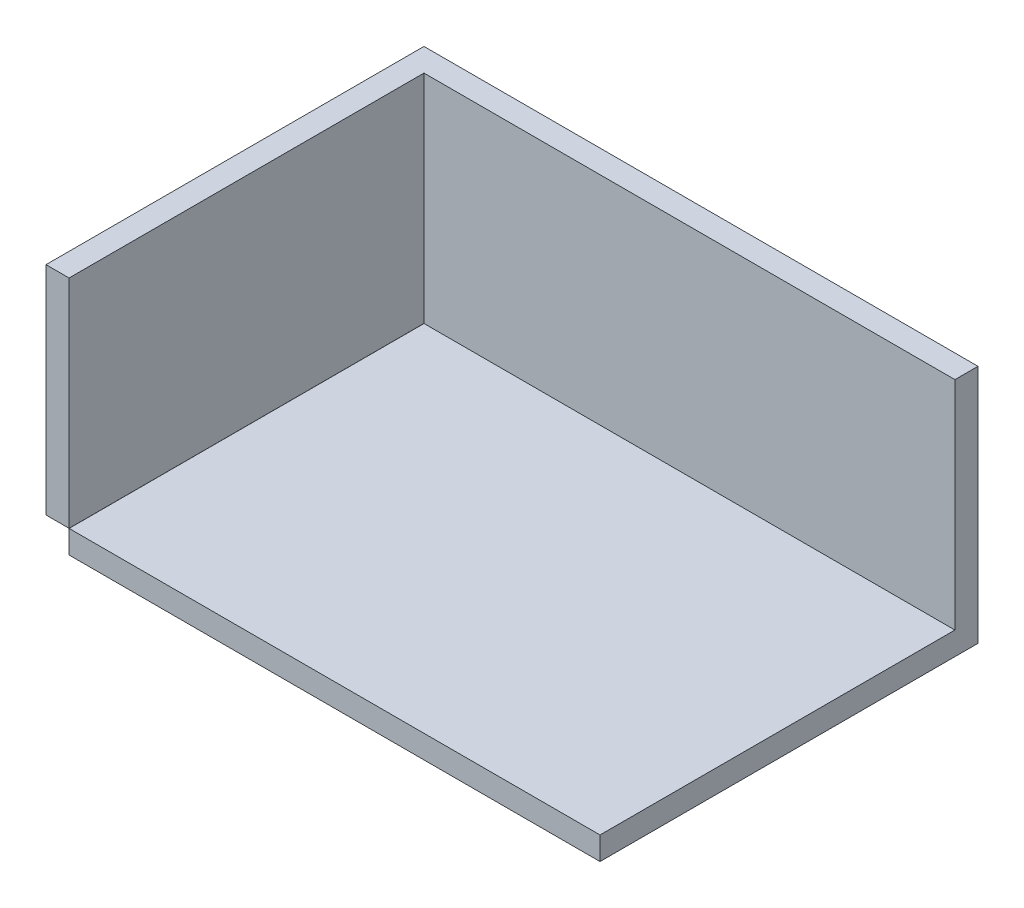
ISO-10303-21;
HEADER;
FILE_DESCRIPTION(('STEP AP214'),'2;1');
FILE_NAME('part.step','',(''),(''),'','','');
FILE_SCHEMA(('AUTOMOTIVE_DESIGN { 1 0 10303 214 1 1 1 1 }'));
ENDSEC;
DATA;
#1=APPLICATION_CONTEXT('core data for automotive mechanical design processes');
#2=APPLICATION_PROTOCOL_DEFINITION('international standard','automotive_design',2000,#1);
#3=PRODUCT_CONTEXT('',#1,'mechanical');
#4=PRODUCT('Part','Part','',(#3));
#5=PRODUCT_RELATED_PRODUCT_CATEGORY('part','',(#4));
#6=PRODUCT_DEFINITION_FORMATION('','',#4);
#7=PRODUCT_DEFINITION_CONTEXT('part definition',#1,'design');
#8=PRODUCT_DEFINITION('design','',#6,#7);
#9=PRODUCT_DEFINITION_SHAPE('','',#8);
#10=(LENGTH_UNIT() NAMED_UNIT(*) SI_UNIT(.MILLI.,.METRE.));
#11=(NAMED_UNIT(*) PLANE_ANGLE_UNIT() SI_UNIT($,.RADIAN.));
#12=(NAMED_UNIT(*) SI_UNIT($,.STERADIAN.) SOLID_ANGLE_UNIT());
#13=UNCERTAINTY_MEASURE_WITH_UNIT(LENGTH_MEASURE(1.E-05),#10,'distance_accuracy_value','');
#14=(GEOMETRIC_REPRESENTATION_CONTEXT(3) GLOBAL_UNCERTAINTY_ASSIGNED_CONTEXT((#13)) GLOBAL_UNIT_ASSIGNED_CONTEXT((#10,
#11,#12)) REPRESENTATION_CONTEXT('',''));
#15=CARTESIAN_POINT('',(0.,0.,0.));
#16=DIRECTION('',(0.,0.,1.));
#17=DIRECTION('',(1.,0.,0.));
#18=AXIS2_PLACEMENT_3D('',#15,#16,#17);
#19=CARTESIAN_POINT('',(-59.6576974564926,5.01,42.078313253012));
#20=DIRECTION('',(0.,-1.,0.));
#21=DIRECTION('',(0.,0.,-1.));
#22=AXIS2_PLACEMENT_3D('',#19,#20,#21);
#23=PLANE('',#22);
#24=DIRECTION('',(0.,0.,-1.));
#25=VECTOR('',#24,1.);
#26=CARTESIAN_POINT('',(-54.6476974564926,5.01,-34.8341365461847));
#27=LINE('',#26,#25);
#28=CARTESIAN_POINT('',(-54.6476974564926,5.01,-34.8341365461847));
#29=VERTEX_POINT('',#28);
#30=CARTESIAN_POINT('',(-54.6476974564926,5.01,-39.8341365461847));
#31=VERTEX_POINT('',#30);
#32=EDGE_CURVE('E11',#29,#31,#27,.T.);
#33=ORIENTED_EDGE('',*,*,#32,.F.);
#34=DIRECTION('',(1.,0.,0.));
#35=VECTOR('',#34,1.);
#36=CARTESIAN_POINT('',(-54.6576974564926,5.01,-34.8341365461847));
#37=LINE('',#36,#35);
#38=CARTESIAN_POINT('',(-54.6576974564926,5.01,-34.8341365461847));
#39=VERTEX_POINT('',#38);
#40=EDGE_CURVE('E153',#39,#29,#37,.T.);
#41=ORIENTED_EDGE('',*,*,#40,.F.);
#42=DIRECTION('',(0.,0.,1.));
#43=VECTOR('',#42,1.);
#44=CARTESIAN_POINT('',(-54.6576974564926,5.01,-34.8341365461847));
#45=LINE('',#44,#43);
#46=CARTESIAN_POINT('',(-54.6576974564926,5.01,42.078313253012));
#47=VERTEX_POINT('',#46);
#48=EDGE_CURVE('E147',#39,#47,#45,.T.);
#49=ORIENTED_EDGE('',*,*,#48,.T.);
#50=DIRECTION('',(-1.,0.,0.));
#51=VECTOR('',#50,1.);
#52=CARTESIAN_POINT('',(-54.6576974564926,5.01,42.078313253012));
#53=LINE('',#52,#51);
#54=CARTESIAN_POINT('',(-59.6576974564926,5.01,42.078313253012));
#55=VERTEX_POINT('',#54);
#56=EDGE_CURVE('E141',#47,#55,#53,.T.);
#57=ORIENTED_EDGE('',*,*,#56,.T.);
#58=DIRECTION('',(0.,0.,1.));
#59=VECTOR('',#58,1.);
#60=CARTESIAN_POINT('',(-59.6576974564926,5.01,-39.8341365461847));
#61=LINE('',#60,#59);
#62=CARTESIAN_POINT('',(-59.6576974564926,5.01,-39.8341365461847));
#63=VERTEX_POINT('',#62);
#64=EDGE_CURVE('E149',#63,#55,#61,.T.);
#65=ORIENTED_EDGE('',*,*,#64,.F.);
#66=DIRECTION('',(1.,0.,0.));
#67=VECTOR('',#66,1.);
#68=CARTESIAN_POINT('',(-59.6576974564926,5.01,-39.8341365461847));
#69=LINE('',#68,#67);
#70=EDGE_CURVE('E39',#63,#31,#69,.T.);
#71=ORIENTED_EDGE('',*,*,#70,.T.);
#72=EDGE_LOOP('',(#33,#41,#49,#57,#65,#71));
#73=FACE_BOUND('',#72,.T.);
#74=ADVANCED_FACE('F32',(#73),#23,.T.);
#75=CARTESIAN_POINT('',(-59.6576974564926,52.,-34.8341365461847));
#76=DIRECTION('',(0.,0.,1.));
#77=DIRECTION('',(1.,0.,0.));
#78=AXIS2_PLACEMENT_3D('',#75,#76,#77);
#79=PLANE('',#78);
#80=DIRECTION('',(0.,-1.,0.));
#81=VECTOR('',#80,1.);
#82=CARTESIAN_POINT('',(-54.6576974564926,52.,-34.8341365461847));
#83=LINE('',#82,#81);
#84=CARTESIAN_POINT('',(-54.6576974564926,52.,-34.8341365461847));
#85=VERTEX_POINT('',#84);
#86=EDGE_CURVE('E203',#85,#39,#83,.T.);
#87=ORIENTED_EDGE('',*,*,#86,.T.);
#88=ORIENTED_EDGE('',*,*,#40,.T.);
#89=DIRECTION('',(0.,1.,0.));
#90=VECTOR('',#89,1.);
#91=CARTESIAN_POINT('',(-54.6476974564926,5.,-34.8341365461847));
#92=LINE('',#91,#90);
#93=CARTESIAN_POINT('',(-54.6476974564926,5.,-34.8341365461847));
#94=VERTEX_POINT('',#93);
#95=EDGE_CURVE('E151',#94,#29,#92,.T.);
#96=ORIENTED_EDGE('',*,*,#95,.F.);
#97=DIRECTION('',(-1.,0.,0.));
#98=VECTOR('',#97,1.);
#99=CARTESIAN_POINT('',(-59.6576974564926,5.,-34.8341365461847));
#100=LINE('',#99,#98);
#101=CARTESIAN_POINT('',(60.4057563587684,5.,-34.8341365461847));
#102=VERTEX_POINT('',#101);
#103=EDGE_CURVE('E124',#102,#94,#100,.T.);
#104=ORIENTED_EDGE('',*,*,#103,.F.);
#105=DIRECTION('',(0.,-1.,0.));
#106=VECTOR('',#105,1.);
#107=CARTESIAN_POINT('',(60.4057563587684,52.,-34.8341365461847));
#108=LINE('',#107,#106);
#109=CARTESIAN_POINT('',(60.4057563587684,52.,-34.8341365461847));
#110=VERTEX_POINT('',#109);
#111=EDGE_CURVE('E123',#110,#102,#108,.T.);
#112=ORIENTED_EDGE('',*,*,#111,.F.);
#113=DIRECTION('',(-1.,0.,0.));
#114=VECTOR('',#113,1.);
#115=CARTESIAN_POINT('',(-59.6576974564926,52.,-34.8341365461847));
#116=LINE('',#115,#114);
#117=EDGE_CURVE('E199',#110,#85,#116,.T.);
#118=ORIENTED_EDGE('',*,*,#117,.T.);
#119=EDGE_LOOP('',(#87,#88,#96,#104,#112,#118));
#120=FACE_BOUND('',#119,.T.);
#121=ADVANCED_FACE('F207',(#120),#79,.T.);
#122=CARTESIAN_POINT('',(-59.6576974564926,52.,-39.8341365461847));
#123=DIRECTION('',(1.,0.,0.));
#124=DIRECTION('',(0.,0.,-1.));
#125=AXIS2_PLACEMENT_3D('',#122,#123,#124);
#126=PLANE('',#125);
#127=DIRECTION('',(0.,-1.,0.));
#128=VECTOR('',#127,1.);
#129=CARTESIAN_POINT('',(-59.6576974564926,52.,-39.8341365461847));
#130=LINE('',#129,#128);
#131=CARTESIAN_POINT('',(-59.6576974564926,52.,-39.8341365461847));
#132=VERTEX_POINT('',#131);
#133=EDGE_CURVE('E136',#132,#63,#130,.T.);
#134=ORIENTED_EDGE('',*,*,#133,.T.);
#135=ORIENTED_EDGE('',*,*,#64,.T.);
#136=DIRECTION('',(0.,-1.,0.));
#137=VECTOR('',#136,1.);
#138=CARTESIAN_POINT('',(-59.6576974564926,52.,42.078313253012));
#139=LINE('',#138,#137);
#140=CARTESIAN_POINT('',(-59.6576974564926,52.,42.078313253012));
#141=VERTEX_POINT('',#140);
#142=EDGE_CURVE('E129',#141,#55,#139,.T.);
#143=ORIENTED_EDGE('',*,*,#142,.F.);
#144=DIRECTION('',(0.,0.,1.));
#145=VECTOR('',#144,1.);
#146=CARTESIAN_POINT('',(-59.6576974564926,52.,-39.8341365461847));
#147=LINE('',#146,#145);
#148=EDGE_CURVE('E180',#132,#141,#147,.T.);
#149=ORIENTED_EDGE('',*,*,#148,.F.);
#150=EDGE_LOOP('',(#134,#135,#143,#149));
#151=FACE_BOUND('',#150,.T.);
#152=ADVANCED_FACE('F191',(#151),#126,.F.);
#153=CARTESIAN_POINT('',(-59.6576974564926,5.,42.078313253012));
#154=DIRECTION('',(0.,1.,0.));
#155=DIRECTION('',(0.,0.,1.));
#156=AXIS2_PLACEMENT_3D('',#153,#154,#155);
#157=PLANE('',#156);
#158=ORIENTED_EDGE('',*,*,#103,.T.);
#159=DIRECTION('',(0.,0.,1.));
#160=VECTOR('',#159,1.);
#161=CARTESIAN_POINT('',(-54.6476974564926,5.,-34.8341365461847));
#162=LINE('',#161,#160);
#163=CARTESIAN_POINT('',(-54.6476974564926,5.,42.078313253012));
#164=VERTEX_POINT('',#163);
#165=EDGE_CURVE('E110',#94,#164,#162,.T.);
#166=ORIENTED_EDGE('',*,*,#165,.T.);
#167=DIRECTION('',(1.,0.,0.));
#168=VECTOR('',#167,1.);
#169=CARTESIAN_POINT('',(-59.6576974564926,5.,42.078313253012));
#170=LINE('',#169,#168);
#171=CARTESIAN_POINT('',(60.4057563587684,5.,42.078313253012));
#172=VERTEX_POINT('',#171);
#173=EDGE_CURVE('E103',#164,#172,#170,.T.);
#174=ORIENTED_EDGE('',*,*,#173,.T.);
#175=DIRECTION('',(0.,0.,-1.));
#176=VECTOR('',#175,1.);
#177=CARTESIAN_POINT('',(60.4057563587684,5.,-39.8341365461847));
#178=LINE('',#177,#176);
#179=EDGE_CURVE('E107',#172,#102,#178,.T.);
#180=ORIENTED_EDGE('',*,*,#179,.T.);
#181=EDGE_LOOP('',(#158,#166,#174,#180));
#182=FACE_BOUND('',#181,.T.);
#183=ADVANCED_FACE('F106',(#182),#157,.T.);
#184=CARTESIAN_POINT('',(-54.6476974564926,5.,42.078313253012));
#185=DIRECTION('',(-1.,0.,0.));
#186=DIRECTION('',(0.,0.,1.));
#187=AXIS2_PLACEMENT_3D('',#184,#185,#186);
#188=PLANE('',#187);
#189=DIRECTION('',(0.,-1.,0.));
#190=VECTOR('',#189,1.);
#191=CARTESIAN_POINT('',(-54.6476974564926,5.,42.078313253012));
#192=LINE('',#191,#190);
#193=CARTESIAN_POINT('',(-54.6476974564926,0.,42.078313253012));
#194=VERTEX_POINT('',#193);
#195=EDGE_CURVE('E133',#164,#194,#192,.T.);
#196=ORIENTED_EDGE('',*,*,#195,.F.);
#197=ORIENTED_EDGE('',*,*,#165,.F.);
#198=ORIENTED_EDGE('',*,*,#95,.T.);
#199=ORIENTED_EDGE('',*,*,#32,.T.);
#200=DIRECTION('',(0.,1.,0.));
#201=VECTOR('',#200,1.);
#202=CARTESIAN_POINT('',(-54.6476974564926,0.,-39.8341365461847));
#203=LINE('',#202,#201);
#204=CARTESIAN_POINT('',(-54.6476974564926,0.,-39.8341365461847));
#205=VERTEX_POINT('',#204);
#206=EDGE_CURVE('E155',#205,#31,#203,.T.);
#207=ORIENTED_EDGE('',*,*,#206,.F.);
#208=DIRECTION('',(0.,0.,1.));
#209=VECTOR('',#208,1.);
#210=CARTESIAN_POINT('',(-54.6476974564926,0.,-39.8341365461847));
#211=LINE('',#210,#209);
#212=EDGE_CURVE('E145',#205,#194,#211,.T.);
#213=ORIENTED_EDGE('',*,*,#212,.T.);
#214=EDGE_LOOP('',(#196,#197,#198,#199,#207,#213));
#215=FACE_BOUND('',#214,.T.);
#216=ADVANCED_FACE('F166',(#215),#188,.T.);
#217=CARTESIAN_POINT('',(-59.6576974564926,52.,42.078313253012));
#218=DIRECTION('',(0.,0.,-1.));
#219=DIRECTION('',(-1.,0.,0.));
#220=AXIS2_PLACEMENT_3D('',#217,#218,#219);
#221=PLANE('',#220);
#222=ORIENTED_EDGE('',*,*,#173,.F.);
#223=ORIENTED_EDGE('',*,*,#195,.T.);
#224=DIRECTION('',(1.,0.,0.));
#225=VECTOR('',#224,1.);
#226=CARTESIAN_POINT('',(-59.6576974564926,0.,42.078313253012));
#227=LINE('',#226,#225);
#228=CARTESIAN_POINT('',(60.4057563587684,0.,42.078313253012));
#229=VERTEX_POINT('',#228);
#230=EDGE_CURVE('E128',#194,#229,#227,.T.);
#231=ORIENTED_EDGE('',*,*,#230,.T.);
#232=DIRECTION('',(0.,-1.,0.));
#233=VECTOR('',#232,1.);
#234=CARTESIAN_POINT('',(60.4057563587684,52.,42.078313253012));
#235=LINE('',#234,#233);
#236=EDGE_CURVE('E120',#172,#229,#235,.T.);
#237=ORIENTED_EDGE('',*,*,#236,.F.);
#238=EDGE_LOOP('',(#222,#223,#231,#237));
#239=FACE_BOUND('',#238,.T.);
#240=ADVANCED_FACE('F126',(#239),#221,.F.);
#241=ORIENTED_EDGE('',*,*,#56,.F.);
#242=DIRECTION('',(0.,-1.,0.));
#243=VECTOR('',#242,1.);
#244=CARTESIAN_POINT('',(-54.6576974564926,52.,42.078313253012));
#245=LINE('',#244,#243);
#246=CARTESIAN_POINT('',(-54.6576974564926,52.,42.078313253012));
#247=VERTEX_POINT('',#246);
#248=EDGE_CURVE('E170',#247,#47,#245,.T.);
#249=ORIENTED_EDGE('',*,*,#248,.F.);
#250=DIRECTION('',(1.,0.,0.));
#251=VECTOR('',#250,1.);
#252=CARTESIAN_POINT('',(-59.6576974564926,52.,42.078313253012));
#253=LINE('',#252,#251);
#254=EDGE_CURVE('E183',#141,#247,#253,.T.);
#255=ORIENTED_EDGE('',*,*,#254,.F.);
#256=ORIENTED_EDGE('',*,*,#142,.T.);
#257=EDGE_LOOP('',(#241,#249,#255,#256));
#258=FACE_BOUND('',#257,.T.);
#259=ADVANCED_FACE('F214',(#258),#221,.F.);
#260=CARTESIAN_POINT('',(60.4057563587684,52.,-39.8341365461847));
#261=DIRECTION('',(-1.,0.,0.));
#262=DIRECTION('',(0.,0.,1.));
#263=AXIS2_PLACEMENT_3D('',#260,#261,#262);
#264=PLANE('',#263);
#265=ORIENTED_EDGE('',*,*,#179,.F.);
#266=ORIENTED_EDGE('',*,*,#236,.T.);
#267=DIRECTION('',(0.,0.,-1.));
#268=VECTOR('',#267,1.);
#269=CARTESIAN_POINT('',(60.4057563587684,0.,-39.8341365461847));
#270=LINE('',#269,#268);
#271=CARTESIAN_POINT('',(60.4057563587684,0.,-39.8341365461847));
#272=VERTEX_POINT('',#271);
#273=EDGE_CURVE('E169',#229,#272,#270,.T.);
#274=ORIENTED_EDGE('',*,*,#273,.T.);
#275=DIRECTION('',(0.,-1.,0.));
#276=VECTOR('',#275,1.);
#277=CARTESIAN_POINT('',(60.4057563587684,52.,-39.8341365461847));
#278=LINE('',#277,#276);
#279=CARTESIAN_POINT('',(60.4057563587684,52.,-39.8341365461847));
#280=VERTEX_POINT('',#279);
#281=EDGE_CURVE('E130',#280,#272,#278,.T.);
#282=ORIENTED_EDGE('',*,*,#281,.F.);
#283=DIRECTION('',(0.,0.,-1.));
#284=VECTOR('',#283,1.);
#285=CARTESIAN_POINT('',(60.4057563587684,52.,-39.8341365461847));
#286=LINE('',#285,#284);
#287=EDGE_CURVE('E186',#110,#280,#286,.T.);
#288=ORIENTED_EDGE('',*,*,#287,.F.);
#289=ORIENTED_EDGE('',*,*,#111,.T.);
#290=EDGE_LOOP('',(#265,#266,#274,#282,#288,#289));
#291=FACE_BOUND('',#290,.T.);
#292=ADVANCED_FACE('F119',(#291),#264,.F.);
#293=CARTESIAN_POINT('',(-59.6576974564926,52.,-39.8341365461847));
#294=DIRECTION('',(0.,0.,1.));
#295=DIRECTION('',(1.,0.,0.));
#296=AXIS2_PLACEMENT_3D('',#293,#294,#295);
#297=PLANE('',#296);
#298=ORIENTED_EDGE('',*,*,#70,.F.);
#299=ORIENTED_EDGE('',*,*,#133,.F.);
#300=DIRECTION('',(-1.,0.,0.));
#301=VECTOR('',#300,1.);
#302=CARTESIAN_POINT('',(-59.6576974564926,52.,-39.8341365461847));
#303=LINE('',#302,#301);
#304=EDGE_CURVE('E188',#280,#132,#303,.T.);
#305=ORIENTED_EDGE('',*,*,#304,.F.);
#306=ORIENTED_EDGE('',*,*,#281,.T.);
#307=DIRECTION('',(-1.,0.,0.));
#308=VECTOR('',#307,1.);
#309=CARTESIAN_POINT('',(-59.6576974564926,0.,-39.8341365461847));
#310=LINE('',#309,#308);
#311=EDGE_CURVE('E164',#272,#205,#310,.T.);
#312=ORIENTED_EDGE('',*,*,#311,.T.);
#313=ORIENTED_EDGE('',*,*,#206,.T.);
#314=EDGE_LOOP('',(#298,#299,#305,#306,#312,#313));
#315=FACE_BOUND('',#314,.T.);
#316=ADVANCED_FACE('F162',(#315),#297,.F.);
#317=CARTESIAN_POINT('',(-59.6576974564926,52.,42.078313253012));
#318=DIRECTION('',(0.,1.,0.));
#319=DIRECTION('',(0.,0.,1.));
#320=AXIS2_PLACEMENT_3D('',#317,#318,#319);
#321=PLANE('',#320);
#322=DIRECTION('',(0.,0.,1.));
#323=VECTOR('',#322,1.);
#324=CARTESIAN_POINT('',(-54.6576974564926,52.,-39.8341365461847));
#325=LINE('',#324,#323);
#326=EDGE_CURVE('E176',#85,#247,#325,.T.);
#327=ORIENTED_EDGE('',*,*,#326,.F.);
#328=ORIENTED_EDGE('',*,*,#117,.F.);
#329=ORIENTED_EDGE('',*,*,#287,.T.);
#330=ORIENTED_EDGE('',*,*,#304,.T.);
#331=ORIENTED_EDGE('',*,*,#148,.T.);
#332=ORIENTED_EDGE('',*,*,#254,.T.);
#333=EDGE_LOOP('',(#327,#328,#329,#330,#331,#332));
#334=FACE_BOUND('',#333,.T.);
#335=ADVANCED_FACE('F197',(#334),#321,.T.);
#336=CARTESIAN_POINT('',(-59.6576974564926,0.,42.078313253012));
#337=DIRECTION('',(0.,1.,0.));
#338=DIRECTION('',(0.,0.,1.));
#339=AXIS2_PLACEMENT_3D('',#336,#337,#338);
#340=PLANE('',#339);
#341=ORIENTED_EDGE('',*,*,#212,.F.);
#342=ORIENTED_EDGE('',*,*,#311,.F.);
#343=ORIENTED_EDGE('',*,*,#273,.F.);
#344=ORIENTED_EDGE('',*,*,#230,.F.);
#345=EDGE_LOOP('',(#341,#342,#343,#344));
#346=FACE_BOUND('',#345,.T.);
#347=ADVANCED_FACE('F168',(#346),#340,.F.);
#348=CARTESIAN_POINT('',(-54.6576974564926,52.,-39.8341365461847));
#349=DIRECTION('',(1.,0.,0.));
#350=DIRECTION('',(0.,0.,-1.));
#351=AXIS2_PLACEMENT_3D('',#348,#349,#350);
#352=PLANE('',#351);
#353=ORIENTED_EDGE('',*,*,#48,.F.);
#354=ORIENTED_EDGE('',*,*,#86,.F.);
#355=ORIENTED_EDGE('',*,*,#326,.T.);
#356=ORIENTED_EDGE('',*,*,#248,.T.);
#357=EDGE_LOOP('',(#353,#354,#355,#356));
#358=FACE_BOUND('',#357,.T.);
#359=ADVANCED_FACE('F211',(#358),#352,.T.);
#360=CLOSED_SHELL('',(#74,#121,#152,#183,#216,#240,#259,#292,#316,#335,#347,#359));
#361=MANIFOLD_SOLID_BREP('B2',#360);
#362=ADVANCED_BREP_SHAPE_REPRESENTATION('',(#18,#361),#14);
#363=SHAPE_DEFINITION_REPRESENTATION(#9,#362);
ENDSEC;
END-ISO-10303-21;
